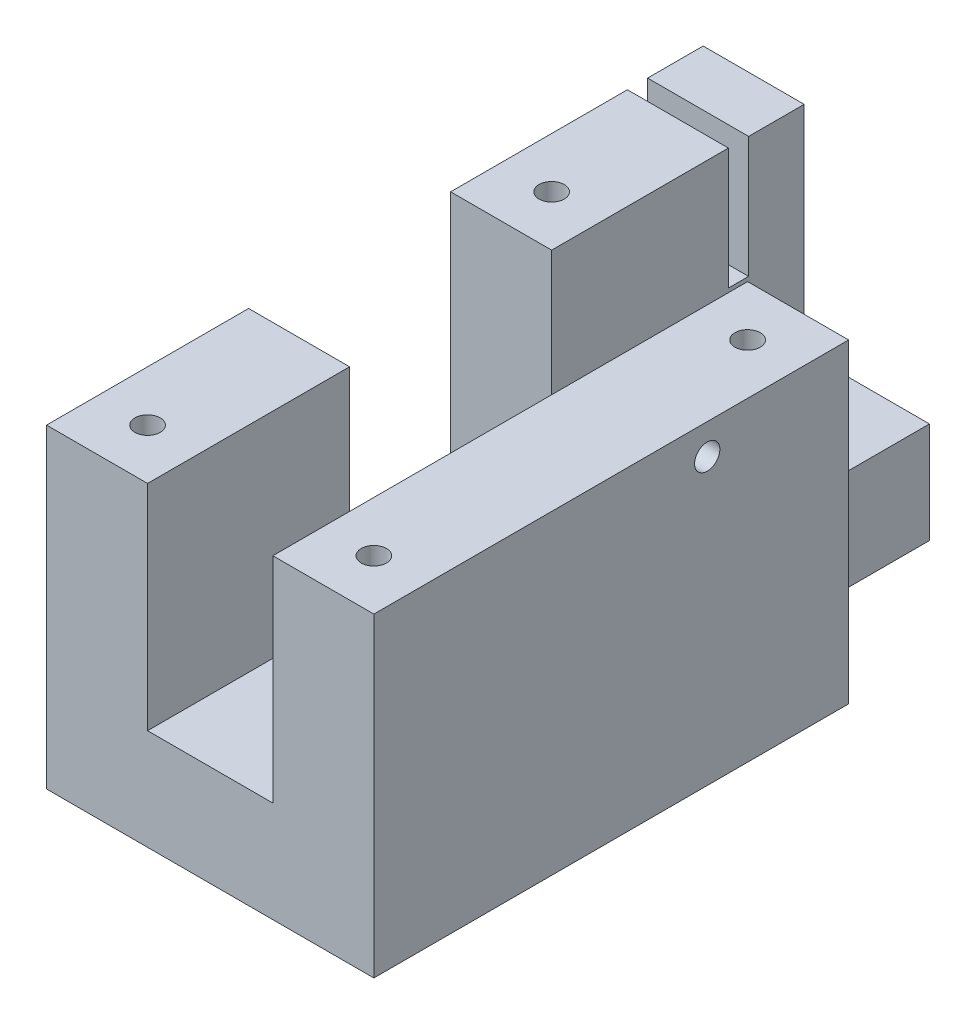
ISO-10303-21;
HEADER;
FILE_DESCRIPTION(('STEP AP214'),'2;1');
FILE_NAME('part.step','',(''),(''),'','','');
FILE_SCHEMA(('AUTOMOTIVE_DESIGN { 1 0 10303 214 1 1 1 1 }'));
ENDSEC;
DATA;
#1=APPLICATION_CONTEXT('core data for automotive mechanical design processes');
#2=APPLICATION_PROTOCOL_DEFINITION('international standard','automotive_design',2000,#1);
#3=PRODUCT_CONTEXT('',#1,'mechanical');
#4=PRODUCT('Part','Part','',(#3));
#5=PRODUCT_RELATED_PRODUCT_CATEGORY('part','',(#4));
#6=PRODUCT_DEFINITION_FORMATION('','',#4);
#7=PRODUCT_DEFINITION_CONTEXT('part definition',#1,'design');
#8=PRODUCT_DEFINITION('design','',#6,#7);
#9=PRODUCT_DEFINITION_SHAPE('','',#8);
#10=(LENGTH_UNIT() NAMED_UNIT(*) SI_UNIT(.MILLI.,.METRE.));
#11=(NAMED_UNIT(*) PLANE_ANGLE_UNIT() SI_UNIT($,.RADIAN.));
#12=(NAMED_UNIT(*) SI_UNIT($,.STERADIAN.) SOLID_ANGLE_UNIT());
#13=UNCERTAINTY_MEASURE_WITH_UNIT(LENGTH_MEASURE(1.E-05),#10,'distance_accuracy_value','');
#14=(GEOMETRIC_REPRESENTATION_CONTEXT(3) GLOBAL_UNCERTAINTY_ASSIGNED_CONTEXT((#13)) GLOBAL_UNIT_ASSIGNED_CONTEXT((#10,
#11,#12)) REPRESENTATION_CONTEXT('',''));
#15=CARTESIAN_POINT('',(0.,0.,0.));
#16=DIRECTION('',(0.,0.,1.));
#17=DIRECTION('',(1.,0.,0.));
#18=AXIS2_PLACEMENT_3D('',#15,#16,#17);
#19=CARTESIAN_POINT('',(10.,10.0000000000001,65.));
#20=DIRECTION('',(-1.,0.,0.));
#21=DIRECTION('',(0.,0.,1.));
#22=AXIS2_PLACEMENT_3D('',#19,#20,#21);
#23=PLANE('',#22);
#24=DIRECTION('',(0.,1.,0.));
#25=VECTOR('',#24,1.);
#26=CARTESIAN_POINT('',(10.,-26.3,45.));
#27=LINE('',#26,#25);
#28=CARTESIAN_POINT('',(10.,10.0000000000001,45.));
#29=VERTEX_POINT('',#28);
#30=CARTESIAN_POINT('',(10.,31.2,45.));
#31=VERTEX_POINT('',#30);
#32=EDGE_CURVE('E309',#29,#31,#27,.T.);
#33=ORIENTED_EDGE('',*,*,#32,.T.);
#34=DIRECTION('',(0.,0.,-1.));
#35=VECTOR('',#34,1.);
#36=CARTESIAN_POINT('',(10.,31.2,65.));
#37=LINE('',#36,#35);
#38=CARTESIAN_POINT('',(10.,31.2,65.));
#39=VERTEX_POINT('',#38);
#40=EDGE_CURVE('E197',#39,#31,#37,.T.);
#41=ORIENTED_EDGE('',*,*,#40,.F.);
#42=DIRECTION('',(0.,1.,0.));
#43=VECTOR('',#42,1.);
#44=CARTESIAN_POINT('',(10.,10.0000000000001,65.));
#45=LINE('',#44,#43);
#46=CARTESIAN_POINT('',(10.,10.0000000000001,65.));
#47=VERTEX_POINT('',#46);
#48=EDGE_CURVE('E250',#47,#39,#45,.T.);
#49=ORIENTED_EDGE('',*,*,#48,.F.);
#50=DIRECTION('',(0.,0.,-1.));
#51=VECTOR('',#50,1.);
#52=CARTESIAN_POINT('',(10.,10.0000000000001,65.));
#53=LINE('',#52,#51);
#54=EDGE_CURVE('E243',#47,#29,#53,.T.);
#55=ORIENTED_EDGE('',*,*,#54,.T.);
#56=EDGE_LOOP('',(#33,#41,#49,#55));
#57=FACE_BOUND('',#56,.T.);
#58=ADVANCED_FACE('F34',(#57),#23,.F.);
#59=DIRECTION('',(0.,1.,0.));
#60=VECTOR('',#59,1.);
#61=CARTESIAN_POINT('',(10.,-26.3,25.));
#62=LINE('',#61,#60);
#63=CARTESIAN_POINT('',(10.,10.0000000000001,25.));
#64=VERTEX_POINT('',#63);
#65=CARTESIAN_POINT('',(10.,31.2,25.));
#66=VERTEX_POINT('',#65);
#67=EDGE_CURVE('E167',#64,#66,#62,.T.);
#68=ORIENTED_EDGE('',*,*,#67,.F.);
#69=CARTESIAN_POINT('',(10.,10.0000000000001,0.));
#70=VERTEX_POINT('',#69);
#71=EDGE_CURVE('E246',#64,#70,#53,.T.);
#72=ORIENTED_EDGE('',*,*,#71,.T.);
#73=DIRECTION('',(0.,1.,0.));
#74=VECTOR('',#73,1.);
#75=CARTESIAN_POINT('',(10.,10.0000000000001,0.));
#76=LINE('',#75,#74);
#77=CARTESIAN_POINT('',(10.,31.2,0.));
#78=VERTEX_POINT('',#77);
#79=EDGE_CURVE('E205',#70,#78,#76,.T.);
#80=ORIENTED_EDGE('',*,*,#79,.T.);
#81=CARTESIAN_POINT('',(10.,31.1999999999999,5.49999999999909));
#82=VERTEX_POINT('',#81);
#83=EDGE_CURVE('E192',#82,#78,#37,.T.);
#84=ORIENTED_EDGE('',*,*,#83,.F.);
#85=DIRECTION('',(0.,1.,0.));
#86=VECTOR('',#85,1.);
#87=CARTESIAN_POINT('',(10.,10.0000000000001,5.49999999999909));
#88=LINE('',#87,#86);
#89=CARTESIAN_POINT('',(10.,19.1999999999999,5.49999999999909));
#90=VERTEX_POINT('',#89);
#91=EDGE_CURVE('E285',#90,#82,#88,.T.);
#92=ORIENTED_EDGE('',*,*,#91,.F.);
#93=DIRECTION('',(0.,0.,-1.));
#94=VECTOR('',#93,1.);
#95=CARTESIAN_POINT('',(10.,19.1999999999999,65.));
#96=LINE('',#95,#94);
#97=CARTESIAN_POINT('',(10.,19.1999999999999,7.5));
#98=VERTEX_POINT('',#97);
#99=EDGE_CURVE('E281',#98,#90,#96,.T.);
#100=ORIENTED_EDGE('',*,*,#99,.F.);
#101=DIRECTION('',(0.,-1.,0.));
#102=VECTOR('',#101,1.);
#103=CARTESIAN_POINT('',(10.,10.0000000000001,7.5));
#104=LINE('',#103,#102);
#105=CARTESIAN_POINT('',(10.,31.1999999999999,7.5));
#106=VERTEX_POINT('',#105);
#107=EDGE_CURVE('E277',#106,#98,#104,.T.);
#108=ORIENTED_EDGE('',*,*,#107,.F.);
#109=EDGE_CURVE('E201',#66,#106,#37,.T.);
#110=ORIENTED_EDGE('',*,*,#109,.F.);
#111=EDGE_LOOP('',(#68,#72,#80,#84,#92,#100,#108,#110));
#112=FACE_BOUND('',#111,.T.);
#113=ADVANCED_FACE('F388',(#112),#23,.F.);
#114=CARTESIAN_POINT('',(0.,31.2,65.));
#115=DIRECTION('',(0.,-1.,0.));
#116=DIRECTION('',(0.,0.,-1.));
#117=AXIS2_PLACEMENT_3D('',#114,#115,#116);
#118=PLANE('',#117);
#119=CARTESIAN_POINT('',(5.,31.2,60.));
#120=DIRECTION('',(0.,1.,0.));
#121=DIRECTION('',(0.,0.,1.));
#122=AXIS2_PLACEMENT_3D('',#119,#120,#121);
#123=CIRCLE('',#122,1.25);
#124=CARTESIAN_POINT('',(5.,31.2,61.25));
#125=VERTEX_POINT('',#124);
#126=EDGE_CURVE('E332',#125,#125,#123,.T.);
#127=ORIENTED_EDGE('',*,*,#126,.F.);
#128=EDGE_LOOP('',(#127));
#129=FACE_BOUND('',#128,.T.);
#130=DIRECTION('',(-1.,0.,0.));
#131=VECTOR('',#130,1.);
#132=CARTESIAN_POINT('',(0.,31.2,45.));
#133=LINE('',#132,#131);
#134=CARTESIAN_POINT('',(0.,31.2,45.));
#135=VERTEX_POINT('',#134);
#136=EDGE_CURVE('E171',#31,#135,#133,.T.);
#137=ORIENTED_EDGE('',*,*,#136,.T.);
#138=DIRECTION('',(0.,0.,-1.));
#139=VECTOR('',#138,1.);
#140=CARTESIAN_POINT('',(0.,31.2,65.));
#141=LINE('',#140,#139);
#142=CARTESIAN_POINT('',(0.,31.2,65.));
#143=VERTEX_POINT('',#142);
#144=EDGE_CURVE('E188',#143,#135,#141,.T.);
#145=ORIENTED_EDGE('',*,*,#144,.F.);
#146=DIRECTION('',(-1.,0.,0.));
#147=VECTOR('',#146,1.);
#148=CARTESIAN_POINT('',(0.,31.2,65.));
#149=LINE('',#148,#147);
#150=EDGE_CURVE('E271',#39,#143,#149,.T.);
#151=ORIENTED_EDGE('',*,*,#150,.F.);
#152=ORIENTED_EDGE('',*,*,#40,.T.);
#153=EDGE_LOOP('',(#137,#145,#151,#152));
#154=FACE_BOUND('',#153,.T.);
#155=ADVANCED_FACE('F393',(#129,#154),#118,.F.);
#156=CARTESIAN_POINT('',(5.,31.2,20.));
#157=DIRECTION('',(0.,1.,0.));
#158=DIRECTION('',(0.,0.,1.));
#159=AXIS2_PLACEMENT_3D('',#156,#157,#158);
#160=CIRCLE('',#159,1.25);
#161=CARTESIAN_POINT('',(5.,31.2,21.25));
#162=VERTEX_POINT('',#161);
#163=EDGE_CURVE('E338',#162,#162,#160,.T.);
#164=ORIENTED_EDGE('',*,*,#163,.F.);
#165=EDGE_LOOP('',(#164));
#166=FACE_BOUND('',#165,.T.);
#167=DIRECTION('',(1.,0.,0.));
#168=VECTOR('',#167,1.);
#169=CARTESIAN_POINT('',(0.,31.2,25.));
#170=LINE('',#169,#168);
#171=CARTESIAN_POINT('',(0.,31.2,25.));
#172=VERTEX_POINT('',#171);
#173=EDGE_CURVE('E160',#172,#66,#170,.T.);
#174=ORIENTED_EDGE('',*,*,#173,.T.);
#175=ORIENTED_EDGE('',*,*,#109,.T.);
#176=DIRECTION('',(1.,0.,0.));
#177=VECTOR('',#176,1.);
#178=CARTESIAN_POINT('',(-25.0999999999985,31.1999999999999,7.5));
#179=LINE('',#178,#177);
#180=CARTESIAN_POINT('',(0.,31.1999999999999,7.5));
#181=VERTEX_POINT('',#180);
#182=EDGE_CURVE('E187',#181,#106,#179,.T.);
#183=ORIENTED_EDGE('',*,*,#182,.F.);
#184=EDGE_CURVE('E178',#172,#181,#141,.T.);
#185=ORIENTED_EDGE('',*,*,#184,.F.);
#186=EDGE_LOOP('',(#174,#175,#183,#185));
#187=FACE_BOUND('',#186,.T.);
#188=ADVANCED_FACE('F185',(#166,#187),#118,.F.);
#189=CARTESIAN_POINT('',(0.,1.13686837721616E-13,65.));
#190=DIRECTION('',(1.,0.,0.));
#191=DIRECTION('',(0.,0.,-1.));
#192=AXIS2_PLACEMENT_3D('',#189,#190,#191);
#193=PLANE('',#192);
#194=DIRECTION('',(0.,1.,0.));
#195=VECTOR('',#194,1.);
#196=CARTESIAN_POINT('',(0.,-26.3,45.));
#197=LINE('',#196,#195);
#198=CARTESIAN_POINT('',(0.,1.14491749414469E-13,45.));
#199=VERTEX_POINT('',#198);
#200=EDGE_CURVE('E211',#199,#135,#197,.T.);
#201=ORIENTED_EDGE('',*,*,#200,.F.);
#202=DIRECTION('',(0.,0.,-1.));
#203=VECTOR('',#202,1.);
#204=CARTESIAN_POINT('',(0.,1.13686837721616E-13,65.));
#205=LINE('',#204,#203);
#206=CARTESIAN_POINT('',(0.,1.13686837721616E-13,65.));
#207=VERTEX_POINT('',#206);
#208=EDGE_CURVE('E193',#207,#199,#205,.T.);
#209=ORIENTED_EDGE('',*,*,#208,.F.);
#210=DIRECTION('',(0.,-1.,0.));
#211=VECTOR('',#210,1.);
#212=CARTESIAN_POINT('',(0.,1.13686837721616E-13,65.));
#213=LINE('',#212,#211);
#214=EDGE_CURVE('E269',#143,#207,#213,.T.);
#215=ORIENTED_EDGE('',*,*,#214,.F.);
#216=ORIENTED_EDGE('',*,*,#144,.T.);
#217=EDGE_LOOP('',(#201,#209,#215,#216));
#218=FACE_BOUND('',#217,.T.);
#219=ADVANCED_FACE('F218',(#218),#193,.F.);
#220=DIRECTION('',(0.,1.,0.));
#221=VECTOR('',#220,1.);
#222=CARTESIAN_POINT('',(0.,-26.3,25.));
#223=LINE('',#222,#221);
#224=CARTESIAN_POINT('',(0.,1.14491749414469E-13,25.));
#225=VERTEX_POINT('',#224);
#226=EDGE_CURVE('E163',#225,#172,#223,.T.);
#227=ORIENTED_EDGE('',*,*,#226,.T.);
#228=ORIENTED_EDGE('',*,*,#184,.T.);
#229=DIRECTION('',(0.,1.,0.));
#230=VECTOR('',#229,1.);
#231=CARTESIAN_POINT('',(0.,1.13686837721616E-13,7.5));
#232=LINE('',#231,#230);
#233=CARTESIAN_POINT('',(0.,19.1999999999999,7.5));
#234=VERTEX_POINT('',#233);
#235=EDGE_CURVE('E279',#234,#181,#232,.T.);
#236=ORIENTED_EDGE('',*,*,#235,.F.);
#237=DIRECTION('',(0.,0.,1.));
#238=VECTOR('',#237,1.);
#239=CARTESIAN_POINT('',(0.,19.1999999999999,65.));
#240=LINE('',#239,#238);
#241=CARTESIAN_POINT('',(0.,19.1999999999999,5.49999999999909));
#242=VERTEX_POINT('',#241);
#243=EDGE_CURVE('E283',#242,#234,#240,.T.);
#244=ORIENTED_EDGE('',*,*,#243,.F.);
#245=DIRECTION('',(0.,-1.,0.));
#246=VECTOR('',#245,1.);
#247=CARTESIAN_POINT('',(0.,1.13686837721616E-13,5.49999999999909));
#248=LINE('',#247,#246);
#249=CARTESIAN_POINT('',(0.,31.2,5.49999999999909));
#250=VERTEX_POINT('',#249);
#251=EDGE_CURVE('E287',#250,#242,#248,.T.);
#252=ORIENTED_EDGE('',*,*,#251,.F.);
#253=CARTESIAN_POINT('',(0.,31.2,0.));
#254=VERTEX_POINT('',#253);
#255=EDGE_CURVE('E189',#250,#254,#141,.T.);
#256=ORIENTED_EDGE('',*,*,#255,.T.);
#257=DIRECTION('',(0.,-1.,0.));
#258=VECTOR('',#257,1.);
#259=CARTESIAN_POINT('',(0.,1.13686837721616E-13,0.));
#260=LINE('',#259,#258);
#261=CARTESIAN_POINT('',(0.,1.13686837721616E-13,0.));
#262=VERTEX_POINT('',#261);
#263=EDGE_CURVE('E253',#254,#262,#260,.T.);
#264=ORIENTED_EDGE('',*,*,#263,.T.);
#265=EDGE_CURVE('E181',#225,#262,#205,.T.);
#266=ORIENTED_EDGE('',*,*,#265,.F.);
#267=EDGE_LOOP('',(#227,#228,#236,#244,#252,#256,#264,#266));
#268=FACE_BOUND('',#267,.T.);
#269=ADVANCED_FACE('F176',(#268),#193,.F.);
#270=CARTESIAN_POINT('',(32.4000000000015,1.13686837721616E-13,65.));
#271=DIRECTION('',(-1.,0.,0.));
#272=DIRECTION('',(0.,0.,1.));
#273=AXIS2_PLACEMENT_3D('',#270,#271,#272);
#274=PLANE('',#273);
#275=CARTESIAN_POINT('',(32.4000000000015,28.1999999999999,32.));
#276=DIRECTION('',(1.,0.,0.));
#277=DIRECTION('',(0.,0.,-1.));
#278=AXIS2_PLACEMENT_3D('',#275,#276,#277);
#279=CIRCLE('',#278,1.25);
#280=CARTESIAN_POINT('',(32.4000000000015,28.1999999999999,30.75));
#281=VERTEX_POINT('',#280);
#282=EDGE_CURVE('E206',#281,#281,#279,.T.);
#283=ORIENTED_EDGE('',*,*,#282,.F.);
#284=EDGE_LOOP('',(#283));
#285=FACE_BOUND('',#284,.T.);
#286=DIRECTION('',(0.,1.,0.));
#287=VECTOR('',#286,1.);
#288=CARTESIAN_POINT('',(32.4000000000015,-26.3,18.));
#289=LINE('',#288,#287);
#290=CARTESIAN_POINT('',(32.4000000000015,1.14491749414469E-13,18.));
#291=VERTEX_POINT('',#290);
#292=CARTESIAN_POINT('',(32.4000000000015,31.2,18.));
#293=VERTEX_POINT('',#292);
#294=EDGE_CURVE('E222',#291,#293,#289,.T.);
#295=ORIENTED_EDGE('',*,*,#294,.T.);
#296=DIRECTION('',(0.,0.,-1.));
#297=VECTOR('',#296,1.);
#298=CARTESIAN_POINT('',(32.4000000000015,31.2,65.));
#299=LINE('',#298,#297);
#300=CARTESIAN_POINT('',(32.4000000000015,31.2,65.));
#301=VERTEX_POINT('',#300);
#302=EDGE_CURVE('E230',#301,#293,#299,.T.);
#303=ORIENTED_EDGE('',*,*,#302,.F.);
#304=DIRECTION('',(0.,1.,0.));
#305=VECTOR('',#304,1.);
#306=CARTESIAN_POINT('',(32.4000000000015,1.13686837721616E-13,65.));
#307=LINE('',#306,#305);
#308=CARTESIAN_POINT('',(32.4000000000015,1.13686837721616E-13,65.));
#309=VERTEX_POINT('',#308);
#310=EDGE_CURVE('E266',#309,#301,#307,.T.);
#311=ORIENTED_EDGE('',*,*,#310,.F.);
#312=DIRECTION('',(0.,0.,-1.));
#313=VECTOR('',#312,1.);
#314=CARTESIAN_POINT('',(32.4000000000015,1.13686837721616E-13,65.));
#315=LINE('',#314,#313);
#316=EDGE_CURVE('E227',#309,#291,#315,.T.);
#317=ORIENTED_EDGE('',*,*,#316,.T.);
#318=EDGE_LOOP('',(#295,#303,#311,#317));
#319=FACE_BOUND('',#318,.T.);
#320=ADVANCED_FACE('F461',(#285,#319),#274,.F.);
#321=CARTESIAN_POINT('',(22.4000000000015,31.2,65.));
#322=DIRECTION('',(0.,-1.,0.));
#323=DIRECTION('',(0.,0.,-1.));
#324=AXIS2_PLACEMENT_3D('',#321,#322,#323);
#325=PLANE('',#324);
#326=CARTESIAN_POINT('',(27.4000000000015,31.2,60.));
#327=DIRECTION('',(0.,1.,0.));
#328=DIRECTION('',(0.,0.,1.));
#329=AXIS2_PLACEMENT_3D('',#326,#327,#328);
#330=CIRCLE('',#329,1.25);
#331=CARTESIAN_POINT('',(27.4000000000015,31.2,61.25));
#332=VERTEX_POINT('',#331);
#333=EDGE_CURVE('E326',#332,#332,#330,.T.);
#334=ORIENTED_EDGE('',*,*,#333,.F.);
#335=EDGE_LOOP('',(#334));
#336=FACE_BOUND('',#335,.T.);
#337=CARTESIAN_POINT('',(27.4000000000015,31.2,23.));
#338=DIRECTION('',(0.,1.,0.));
#339=DIRECTION('',(0.,0.,1.));
#340=AXIS2_PLACEMENT_3D('',#337,#338,#339);
#341=CIRCLE('',#340,1.25);
#342=CARTESIAN_POINT('',(27.4000000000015,31.2,24.25));
#343=VERTEX_POINT('',#342);
#344=EDGE_CURVE('E320',#343,#343,#341,.T.);
#345=ORIENTED_EDGE('',*,*,#344,.F.);
#346=EDGE_LOOP('',(#345));
#347=FACE_BOUND('',#346,.T.);
#348=DIRECTION('',(-1.,0.,0.));
#349=VECTOR('',#348,1.);
#350=CARTESIAN_POINT('',(22.4000000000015,31.2,18.));
#351=LINE('',#350,#349);
#352=CARTESIAN_POINT('',(22.4000000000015,31.2,18.));
#353=VERTEX_POINT('',#352);
#354=EDGE_CURVE('E182',#293,#353,#351,.T.);
#355=ORIENTED_EDGE('',*,*,#354,.T.);
#356=DIRECTION('',(0.,0.,-1.));
#357=VECTOR('',#356,1.);
#358=CARTESIAN_POINT('',(22.4000000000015,31.2,65.));
#359=LINE('',#358,#357);
#360=CARTESIAN_POINT('',(22.4000000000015,31.2,65.));
#361=VERTEX_POINT('',#360);
#362=EDGE_CURVE('E235',#361,#353,#359,.T.);
#363=ORIENTED_EDGE('',*,*,#362,.F.);
#364=DIRECTION('',(-1.,0.,0.));
#365=VECTOR('',#364,1.);
#366=CARTESIAN_POINT('',(22.4000000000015,31.2,65.));
#367=LINE('',#366,#365);
#368=EDGE_CURVE('E264',#301,#361,#367,.T.);
#369=ORIENTED_EDGE('',*,*,#368,.F.);
#370=ORIENTED_EDGE('',*,*,#302,.T.);
#371=EDGE_LOOP('',(#355,#363,#369,#370));
#372=FACE_BOUND('',#371,.T.);
#373=ADVANCED_FACE('F457',(#336,#347,#372),#325,.F.);
#374=CARTESIAN_POINT('',(22.4000000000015,10.0000000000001,65.));
#375=DIRECTION('',(1.,0.,0.));
#376=DIRECTION('',(0.,0.,-1.));
#377=AXIS2_PLACEMENT_3D('',#374,#375,#376);
#378=PLANE('',#377);
#379=CARTESIAN_POINT('',(22.4000000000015,28.1999999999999,32.));
#380=DIRECTION('',(1.,0.,0.));
#381=DIRECTION('',(0.,0.,-1.));
#382=AXIS2_PLACEMENT_3D('',#379,#380,#381);
#383=CIRCLE('',#382,1.25);
#384=CARTESIAN_POINT('',(22.4000000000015,28.1999999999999,30.75));
#385=VERTEX_POINT('',#384);
#386=EDGE_CURVE('E202',#385,#385,#383,.T.);
#387=ORIENTED_EDGE('',*,*,#386,.T.);
#388=EDGE_LOOP('',(#387));
#389=FACE_BOUND('',#388,.T.);
#390=DIRECTION('',(0.,1.,0.));
#391=VECTOR('',#390,1.);
#392=CARTESIAN_POINT('',(22.4000000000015,-26.3,18.));
#393=LINE('',#392,#391);
#394=CARTESIAN_POINT('',(22.4000000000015,10.0000000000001,18.));
#395=VERTEX_POINT('',#394);
#396=EDGE_CURVE('E313',#395,#353,#393,.T.);
#397=ORIENTED_EDGE('',*,*,#396,.F.);
#398=DIRECTION('',(0.,0.,-1.));
#399=VECTOR('',#398,1.);
#400=CARTESIAN_POINT('',(22.4000000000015,10.0000000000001,65.));
#401=LINE('',#400,#399);
#402=CARTESIAN_POINT('',(22.4000000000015,10.0000000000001,65.));
#403=VERTEX_POINT('',#402);
#404=EDGE_CURVE('E240',#403,#395,#401,.T.);
#405=ORIENTED_EDGE('',*,*,#404,.F.);
#406=DIRECTION('',(0.,-1.,0.));
#407=VECTOR('',#406,1.);
#408=CARTESIAN_POINT('',(22.4000000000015,10.0000000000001,65.));
#409=LINE('',#408,#407);
#410=EDGE_CURVE('E262',#361,#403,#409,.T.);
#411=ORIENTED_EDGE('',*,*,#410,.F.);
#412=ORIENTED_EDGE('',*,*,#362,.T.);
#413=EDGE_LOOP('',(#397,#405,#411,#412));
#414=FACE_BOUND('',#413,.T.);
#415=ADVANCED_FACE('F368',(#389,#414),#378,.F.);
#416=CARTESIAN_POINT('',(0.,1.13686837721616E-13,65.));
#417=DIRECTION('',(0.,1.,0.));
#418=DIRECTION('',(0.,0.,1.));
#419=AXIS2_PLACEMENT_3D('',#416,#417,#418);
#420=PLANE('',#419);
#421=CARTESIAN_POINT('',(27.4000000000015,0.,50.));
#422=DIRECTION('',(0.,-1.,0.));
#423=DIRECTION('',(0.,0.,-1.));
#424=AXIS2_PLACEMENT_3D('',#421,#422,#423);
#425=CIRCLE('',#424,2.1);
#426=CARTESIAN_POINT('',(27.4000000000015,0.,47.9));
#427=VERTEX_POINT('',#426);
#428=EDGE_CURVE('E350',#427,#427,#425,.T.);
#429=ORIENTED_EDGE('',*,*,#428,.F.);
#430=EDGE_LOOP('',(#429));
#431=FACE_BOUND('',#430,.T.);
#432=CARTESIAN_POINT('',(5.,0.,50.));
#433=DIRECTION('',(0.,-1.,0.));
#434=DIRECTION('',(0.,0.,-1.));
#435=AXIS2_PLACEMENT_3D('',#432,#433,#434);
#436=CIRCLE('',#435,2.1);
#437=CARTESIAN_POINT('',(5.,0.,47.9));
#438=VERTEX_POINT('',#437);
#439=EDGE_CURVE('E344',#438,#438,#436,.T.);
#440=ORIENTED_EDGE('',*,*,#439,.F.);
#441=EDGE_LOOP('',(#440));
#442=FACE_BOUND('',#441,.T.);
#443=DIRECTION('',(0.,0.,-1.));
#444=VECTOR('',#443,1.);
#445=CARTESIAN_POINT('',(22.4000000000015,1.13686837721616E-13,65.));
#446=LINE('',#445,#444);
#447=CARTESIAN_POINT('',(22.4000000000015,1.14491749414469E-13,18.));
#448=VERTEX_POINT('',#447);
#449=CARTESIAN_POINT('',(22.4000000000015,1.13686837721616E-13,0.));
#450=VERTEX_POINT('',#449);
#451=EDGE_CURVE('E56',#448,#450,#446,.T.);
#452=ORIENTED_EDGE('',*,*,#451,.F.);
#453=DIRECTION('',(-1.,0.,0.));
#454=VECTOR('',#453,1.);
#455=CARTESIAN_POINT('',(0.,1.13686837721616E-13,18.));
#456=LINE('',#455,#454);
#457=EDGE_CURVE('E12',#291,#448,#456,.T.);
#458=ORIENTED_EDGE('',*,*,#457,.F.);
#459=ORIENTED_EDGE('',*,*,#316,.F.);
#460=DIRECTION('',(1.,0.,0.));
#461=VECTOR('',#460,1.);
#462=CARTESIAN_POINT('',(0.,1.13686837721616E-13,65.));
#463=LINE('',#462,#461);
#464=EDGE_CURVE('E226',#207,#309,#463,.T.);
#465=ORIENTED_EDGE('',*,*,#464,.F.);
#466=ORIENTED_EDGE('',*,*,#208,.T.);
#467=DIRECTION('',(-1.,0.,0.));
#468=VECTOR('',#467,1.);
#469=CARTESIAN_POINT('',(0.,1.13686837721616E-13,45.));
#470=LINE('',#469,#468);
#471=CARTESIAN_POINT('',(10.,1.14491749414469E-13,45.));
#472=VERTEX_POINT('',#471);
#473=EDGE_CURVE('E41',#472,#199,#470,.T.);
#474=ORIENTED_EDGE('',*,*,#473,.F.);
#475=DIRECTION('',(0.,0.,1.));
#476=VECTOR('',#475,1.);
#477=CARTESIAN_POINT('',(10.,1.13686837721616E-13,65.));
#478=LINE('',#477,#476);
#479=CARTESIAN_POINT('',(10.,1.14491749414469E-13,25.));
#480=VERTEX_POINT('',#479);
#481=EDGE_CURVE('E293',#480,#472,#478,.T.);
#482=ORIENTED_EDGE('',*,*,#481,.F.);
#483=DIRECTION('',(1.,0.,0.));
#484=VECTOR('',#483,1.);
#485=CARTESIAN_POINT('',(0.,1.13686837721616E-13,25.));
#486=LINE('',#485,#484);
#487=EDGE_CURVE('E200',#225,#480,#486,.T.);
#488=ORIENTED_EDGE('',*,*,#487,.F.);
#489=ORIENTED_EDGE('',*,*,#265,.T.);
#490=DIRECTION('',(1.,0.,0.));
#491=VECTOR('',#490,1.);
#492=CARTESIAN_POINT('',(0.,1.13686837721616E-13,0.));
#493=LINE('',#492,#491);
#494=EDGE_CURVE('E251',#262,#450,#493,.T.);
#495=ORIENTED_EDGE('',*,*,#494,.T.);
#496=EDGE_LOOP('',(#452,#458,#459,#465,#466,#474,#482,#488,#489,#495));
#497=FACE_BOUND('',#496,.T.);
#498=ADVANCED_FACE('F224',(#431,#442,#497),#420,.F.);
#499=CARTESIAN_POINT('',(10.,31.2,0.));
#500=DIRECTION('',(0.,0.,-1.));
#501=DIRECTION('',(-1.,0.,0.));
#502=AXIS2_PLACEMENT_3D('',#499,#500,#501);
#503=PLANE('',#502);
#504=DIRECTION('',(-1.,0.,0.));
#505=VECTOR('',#504,1.);
#506=CARTESIAN_POINT('',(10.,10.0000000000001,0.));
#507=LINE('',#506,#505);
#508=CARTESIAN_POINT('',(22.4000000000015,10.0000000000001,0.));
#509=VERTEX_POINT('',#508);
#510=EDGE_CURVE('E247',#509,#70,#507,.T.);
#511=ORIENTED_EDGE('',*,*,#510,.F.);
#512=DIRECTION('',(0.,1.,0.));
#513=VECTOR('',#512,1.);
#514=CARTESIAN_POINT('',(22.4000000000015,-26.3,0.));
#515=LINE('',#514,#513);
#516=EDGE_CURVE('E305',#450,#509,#515,.T.);
#517=ORIENTED_EDGE('',*,*,#516,.F.);
#518=ORIENTED_EDGE('',*,*,#494,.F.);
#519=ORIENTED_EDGE('',*,*,#263,.F.);
#520=DIRECTION('',(-1.,0.,0.));
#521=VECTOR('',#520,1.);
#522=CARTESIAN_POINT('',(0.,31.2,0.));
#523=LINE('',#522,#521);
#524=EDGE_CURVE('E255',#78,#254,#523,.T.);
#525=ORIENTED_EDGE('',*,*,#524,.F.);
#526=ORIENTED_EDGE('',*,*,#79,.F.);
#527=EDGE_LOOP('',(#511,#517,#518,#519,#525,#526));
#528=FACE_BOUND('',#527,.T.);
#529=ADVANCED_FACE('F367',(#528),#503,.T.);
#530=DIRECTION('',(1.,0.,0.));
#531=VECTOR('',#530,1.);
#532=CARTESIAN_POINT('',(-25.0999999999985,31.1999999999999,5.49999999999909));
#533=LINE('',#532,#531);
#534=EDGE_CURVE('E289',#250,#82,#533,.T.);
#535=ORIENTED_EDGE('',*,*,#534,.T.);
#536=ORIENTED_EDGE('',*,*,#83,.T.);
#537=ORIENTED_EDGE('',*,*,#524,.T.);
#538=ORIENTED_EDGE('',*,*,#255,.F.);
#539=EDGE_LOOP('',(#535,#536,#537,#538));
#540=FACE_BOUND('',#539,.T.);
#541=ADVANCED_FACE('F415',(#540),#118,.F.);
#542=CARTESIAN_POINT('',(10.,10.0000000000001,65.));
#543=DIRECTION('',(0.,-1.,0.));
#544=DIRECTION('',(0.,0.,-1.));
#545=AXIS2_PLACEMENT_3D('',#542,#543,#544);
#546=PLANE('',#545);
#547=ORIENTED_EDGE('',*,*,#510,.T.);
#548=ORIENTED_EDGE('',*,*,#71,.F.);
#549=DIRECTION('',(0.,0.,-1.));
#550=VECTOR('',#549,1.);
#551=CARTESIAN_POINT('',(10.,10.0000000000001,65.));
#552=LINE('',#551,#550);
#553=EDGE_CURVE('E301',#29,#64,#552,.T.);
#554=ORIENTED_EDGE('',*,*,#553,.F.);
#555=ORIENTED_EDGE('',*,*,#54,.F.);
#556=DIRECTION('',(-1.,0.,0.));
#557=VECTOR('',#556,1.);
#558=CARTESIAN_POINT('',(10.,10.0000000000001,65.));
#559=LINE('',#558,#557);
#560=EDGE_CURVE('E260',#403,#47,#559,.T.);
#561=ORIENTED_EDGE('',*,*,#560,.F.);
#562=ORIENTED_EDGE('',*,*,#404,.T.);
#563=DIRECTION('',(0.,0.,1.));
#564=VECTOR('',#563,1.);
#565=CARTESIAN_POINT('',(22.4000000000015,10.0000000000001,65.));
#566=LINE('',#565,#564);
#567=EDGE_CURVE('E304',#509,#395,#566,.T.);
#568=ORIENTED_EDGE('',*,*,#567,.F.);
#569=EDGE_LOOP('',(#547,#548,#554,#555,#561,#562,#568));
#570=FACE_BOUND('',#569,.T.);
#571=ADVANCED_FACE('F406',(#570),#546,.F.);
#572=CARTESIAN_POINT('',(10.,31.2,65.));
#573=DIRECTION('',(0.,0.,-1.));
#574=DIRECTION('',(-1.,0.,0.));
#575=AXIS2_PLACEMENT_3D('',#572,#573,#574);
#576=PLANE('',#575);
#577=ORIENTED_EDGE('',*,*,#48,.T.);
#578=ORIENTED_EDGE('',*,*,#150,.T.);
#579=ORIENTED_EDGE('',*,*,#214,.T.);
#580=ORIENTED_EDGE('',*,*,#464,.T.);
#581=ORIENTED_EDGE('',*,*,#310,.T.);
#582=ORIENTED_EDGE('',*,*,#368,.T.);
#583=ORIENTED_EDGE('',*,*,#410,.T.);
#584=ORIENTED_EDGE('',*,*,#560,.T.);
#585=EDGE_LOOP('',(#577,#578,#579,#580,#581,#582,#583,#584));
#586=FACE_BOUND('',#585,.T.);
#587=ADVANCED_FACE('F401',(#586),#576,.F.);
#588=CARTESIAN_POINT('',(-25.0999999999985,28.1999999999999,32.));
#589=DIRECTION('',(1.,0.,0.));
#590=DIRECTION('',(0.,0.,-1.));
#591=AXIS2_PLACEMENT_3D('',#588,#589,#590);
#592=CYLINDRICAL_SURFACE('',#591,1.25);
#593=ORIENTED_EDGE('',*,*,#282,.T.);
#594=EDGE_LOOP('',(#593));
#595=FACE_BOUND('',#594,.T.);
#596=ORIENTED_EDGE('',*,*,#386,.F.);
#597=EDGE_LOOP('',(#596));
#598=FACE_BOUND('',#597,.T.);
#599=ADVANCED_FACE('F434',(#595,#598),#592,.F.);
#600=CARTESIAN_POINT('',(-25.0999999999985,31.1999999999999,7.5));
#601=DIRECTION('',(0.,0.,-1.));
#602=DIRECTION('',(-1.,0.,0.));
#603=AXIS2_PLACEMENT_3D('',#600,#601,#602);
#604=PLANE('',#603);
#605=ORIENTED_EDGE('',*,*,#107,.T.);
#606=DIRECTION('',(1.,0.,0.));
#607=VECTOR('',#606,1.);
#608=CARTESIAN_POINT('',(-25.0999999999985,19.1999999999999,7.5));
#609=LINE('',#608,#607);
#610=EDGE_CURVE('E296',#234,#98,#609,.T.);
#611=ORIENTED_EDGE('',*,*,#610,.F.);
#612=ORIENTED_EDGE('',*,*,#235,.T.);
#613=ORIENTED_EDGE('',*,*,#182,.T.);
#614=EDGE_LOOP('',(#605,#611,#612,#613));
#615=FACE_BOUND('',#614,.T.);
#616=ADVANCED_FACE('F432',(#615),#604,.T.);
#617=CARTESIAN_POINT('',(-25.0999999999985,19.1999999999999,7.5));
#618=DIRECTION('',(0.,1.,0.));
#619=DIRECTION('',(0.,0.,1.));
#620=AXIS2_PLACEMENT_3D('',#617,#618,#619);
#621=PLANE('',#620);
#622=ORIENTED_EDGE('',*,*,#99,.T.);
#623=DIRECTION('',(1.,0.,0.));
#624=VECTOR('',#623,1.);
#625=CARTESIAN_POINT('',(-25.0999999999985,19.1999999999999,5.49999999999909));
#626=LINE('',#625,#624);
#627=EDGE_CURVE('E292',#242,#90,#626,.T.);
#628=ORIENTED_EDGE('',*,*,#627,.F.);
#629=ORIENTED_EDGE('',*,*,#243,.T.);
#630=ORIENTED_EDGE('',*,*,#610,.T.);
#631=EDGE_LOOP('',(#622,#628,#629,#630));
#632=FACE_BOUND('',#631,.T.);
#633=ADVANCED_FACE('F429',(#632),#621,.T.);
#634=CARTESIAN_POINT('',(-25.0999999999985,31.1999999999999,5.49999999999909));
#635=DIRECTION('',(0.,0.,1.));
#636=DIRECTION('',(1.,0.,0.));
#637=AXIS2_PLACEMENT_3D('',#634,#635,#636);
#638=PLANE('',#637);
#639=ORIENTED_EDGE('',*,*,#91,.T.);
#640=ORIENTED_EDGE('',*,*,#534,.F.);
#641=ORIENTED_EDGE('',*,*,#251,.T.);
#642=ORIENTED_EDGE('',*,*,#627,.T.);
#643=EDGE_LOOP('',(#639,#640,#641,#642));
#644=FACE_BOUND('',#643,.T.);
#645=ADVANCED_FACE('F427',(#644),#638,.T.);
#646=CARTESIAN_POINT('',(22.4000000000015,-26.3,18.));
#647=DIRECTION('',(1.,0.,0.));
#648=DIRECTION('',(0.,0.,-1.));
#649=AXIS2_PLACEMENT_3D('',#646,#647,#648);
#650=PLANE('',#649);
#651=ORIENTED_EDGE('',*,*,#451,.T.);
#652=ORIENTED_EDGE('',*,*,#516,.T.);
#653=ORIENTED_EDGE('',*,*,#567,.T.);
#654=EDGE_CURVE('E315',#448,#395,#393,.T.);
#655=ORIENTED_EDGE('',*,*,#654,.F.);
#656=EDGE_LOOP('',(#651,#652,#653,#655));
#657=FACE_BOUND('',#656,.T.);
#658=ADVANCED_FACE('F447',(#657),#650,.T.);
#659=CARTESIAN_POINT('',(22.4000000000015,-26.3,18.));
#660=DIRECTION('',(0.,0.,-1.));
#661=DIRECTION('',(-1.,0.,0.));
#662=AXIS2_PLACEMENT_3D('',#659,#660,#661);
#663=PLANE('',#662);
#664=ORIENTED_EDGE('',*,*,#457,.T.);
#665=ORIENTED_EDGE('',*,*,#654,.T.);
#666=ORIENTED_EDGE('',*,*,#396,.T.);
#667=ORIENTED_EDGE('',*,*,#354,.F.);
#668=ORIENTED_EDGE('',*,*,#294,.F.);
#669=EDGE_LOOP('',(#664,#665,#666,#667,#668));
#670=FACE_BOUND('',#669,.T.);
#671=ADVANCED_FACE('F672',(#670),#663,.T.);
#672=CARTESIAN_POINT('',(0.,-26.3,45.));
#673=DIRECTION('',(0.,0.,-1.));
#674=DIRECTION('',(-1.,0.,0.));
#675=AXIS2_PLACEMENT_3D('',#672,#673,#674);
#676=PLANE('',#675);
#677=ORIENTED_EDGE('',*,*,#473,.T.);
#678=ORIENTED_EDGE('',*,*,#200,.T.);
#679=ORIENTED_EDGE('',*,*,#136,.F.);
#680=ORIENTED_EDGE('',*,*,#32,.F.);
#681=EDGE_CURVE('E48',#472,#29,#27,.T.);
#682=ORIENTED_EDGE('',*,*,#681,.F.);
#683=EDGE_LOOP('',(#677,#678,#679,#680,#682));
#684=FACE_BOUND('',#683,.T.);
#685=ADVANCED_FACE('F210',(#684),#676,.T.);
#686=CARTESIAN_POINT('',(0.,-26.3,25.));
#687=DIRECTION('',(0.,0.,1.));
#688=DIRECTION('',(1.,0.,0.));
#689=AXIS2_PLACEMENT_3D('',#686,#687,#688);
#690=PLANE('',#689);
#691=ORIENTED_EDGE('',*,*,#487,.T.);
#692=EDGE_CURVE('E308',#480,#64,#62,.T.);
#693=ORIENTED_EDGE('',*,*,#692,.T.);
#694=ORIENTED_EDGE('',*,*,#67,.T.);
#695=ORIENTED_EDGE('',*,*,#173,.F.);
#696=ORIENTED_EDGE('',*,*,#226,.F.);
#697=EDGE_LOOP('',(#691,#693,#694,#695,#696));
#698=FACE_BOUND('',#697,.T.);
#699=ADVANCED_FACE('F162',(#698),#690,.T.);
#700=CARTESIAN_POINT('',(10.,-26.3,45.));
#701=DIRECTION('',(-1.,0.,0.));
#702=DIRECTION('',(0.,0.,1.));
#703=AXIS2_PLACEMENT_3D('',#700,#701,#702);
#704=PLANE('',#703);
#705=ORIENTED_EDGE('',*,*,#481,.T.);
#706=ORIENTED_EDGE('',*,*,#681,.T.);
#707=ORIENTED_EDGE('',*,*,#553,.T.);
#708=ORIENTED_EDGE('',*,*,#692,.F.);
#709=EDGE_LOOP('',(#705,#706,#707,#708));
#710=FACE_BOUND('',#709,.T.);
#711=ADVANCED_FACE('F409',(#710),#704,.T.);
#712=CARTESIAN_POINT('',(27.4000000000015,19.2,23.));
#713=DIRECTION('',(0.,1.,0.));
#714=DIRECTION('',(0.,0.,1.));
#715=AXIS2_PLACEMENT_3D('',#712,#713,#714);
#716=CYLINDRICAL_SURFACE('',#715,1.25);
#717=CARTESIAN_POINT('',(27.4000000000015,19.2,23.));
#718=DIRECTION('',(0.,1.,0.));
#719=DIRECTION('',(0.,0.,1.));
#720=AXIS2_PLACEMENT_3D('',#717,#718,#719);
#721=CIRCLE('',#720,1.25);
#722=CARTESIAN_POINT('',(27.4000000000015,19.2,24.25));
#723=VERTEX_POINT('',#722);
#724=EDGE_CURVE('E172',#723,#723,#721,.T.);
#725=ORIENTED_EDGE('',*,*,#724,.F.);
#726=EDGE_LOOP('',(#725));
#727=FACE_BOUND('',#726,.T.);
#728=ORIENTED_EDGE('',*,*,#344,.T.);
#729=EDGE_LOOP('',(#728));
#730=FACE_BOUND('',#729,.T.);
#731=ADVANCED_FACE('F642',(#727,#730),#716,.F.);
#732=CARTESIAN_POINT('',(27.4000000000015,19.2,23.));
#733=DIRECTION('',(0.,1.,0.));
#734=DIRECTION('',(0.,0.,1.));
#735=AXIS2_PLACEMENT_3D('',#732,#733,#734);
#736=PLANE('',#735);
#737=ORIENTED_EDGE('',*,*,#724,.T.);
#738=EDGE_LOOP('',(#737));
#739=FACE_BOUND('',#738,.T.);
#740=ADVANCED_FACE('F633',(#739),#736,.T.);
#741=CARTESIAN_POINT('',(27.4000000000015,19.2,60.));
#742=DIRECTION('',(0.,1.,0.));
#743=DIRECTION('',(0.,0.,1.));
#744=AXIS2_PLACEMENT_3D('',#741,#742,#743);
#745=CYLINDRICAL_SURFACE('',#744,1.25);
#746=CARTESIAN_POINT('',(27.4000000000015,19.2,60.));
#747=DIRECTION('',(0.,1.,0.));
#748=DIRECTION('',(0.,0.,1.));
#749=AXIS2_PLACEMENT_3D('',#746,#747,#748);
#750=CIRCLE('',#749,1.25);
#751=CARTESIAN_POINT('',(27.4000000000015,19.2,61.25));
#752=VERTEX_POINT('',#751);
#753=EDGE_CURVE('E323',#752,#752,#750,.T.);
#754=ORIENTED_EDGE('',*,*,#753,.F.);
#755=EDGE_LOOP('',(#754));
#756=FACE_BOUND('',#755,.T.);
#757=ORIENTED_EDGE('',*,*,#333,.T.);
#758=EDGE_LOOP('',(#757));
#759=FACE_BOUND('',#758,.T.);
#760=ADVANCED_FACE('F624',(#756,#759),#745,.F.);
#761=CARTESIAN_POINT('',(27.4000000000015,19.2,60.));
#762=DIRECTION('',(0.,1.,0.));
#763=DIRECTION('',(0.,0.,1.));
#764=AXIS2_PLACEMENT_3D('',#761,#762,#763);
#765=PLANE('',#764);
#766=ORIENTED_EDGE('',*,*,#753,.T.);
#767=EDGE_LOOP('',(#766));
#768=FACE_BOUND('',#767,.T.);
#769=ADVANCED_FACE('F615',(#768),#765,.T.);
#770=CARTESIAN_POINT('',(5.,19.2,60.));
#771=DIRECTION('',(0.,1.,0.));
#772=DIRECTION('',(0.,0.,1.));
#773=AXIS2_PLACEMENT_3D('',#770,#771,#772);
#774=CYLINDRICAL_SURFACE('',#773,1.25);
#775=CARTESIAN_POINT('',(5.,19.2,60.));
#776=DIRECTION('',(0.,1.,0.));
#777=DIRECTION('',(0.,0.,1.));
#778=AXIS2_PLACEMENT_3D('',#775,#776,#777);
#779=CIRCLE('',#778,1.25);
#780=CARTESIAN_POINT('',(5.,19.2,61.25));
#781=VERTEX_POINT('',#780);
#782=EDGE_CURVE('E329',#781,#781,#779,.T.);
#783=ORIENTED_EDGE('',*,*,#782,.F.);
#784=EDGE_LOOP('',(#783));
#785=FACE_BOUND('',#784,.T.);
#786=ORIENTED_EDGE('',*,*,#126,.T.);
#787=EDGE_LOOP('',(#786));
#788=FACE_BOUND('',#787,.T.);
#789=ADVANCED_FACE('F606',(#785,#788),#774,.F.);
#790=CARTESIAN_POINT('',(5.,19.2,60.));
#791=DIRECTION('',(0.,1.,0.));
#792=DIRECTION('',(0.,0.,1.));
#793=AXIS2_PLACEMENT_3D('',#790,#791,#792);
#794=PLANE('',#793);
#795=ORIENTED_EDGE('',*,*,#782,.T.);
#796=EDGE_LOOP('',(#795));
#797=FACE_BOUND('',#796,.T.);
#798=ADVANCED_FACE('F597',(#797),#794,.T.);
#799=CARTESIAN_POINT('',(5.,19.2,20.));
#800=DIRECTION('',(0.,1.,0.));
#801=DIRECTION('',(0.,0.,1.));
#802=AXIS2_PLACEMENT_3D('',#799,#800,#801);
#803=CYLINDRICAL_SURFACE('',#802,1.25);
#804=CARTESIAN_POINT('',(5.,19.2,20.));
#805=DIRECTION('',(0.,1.,0.));
#806=DIRECTION('',(0.,0.,1.));
#807=AXIS2_PLACEMENT_3D('',#804,#805,#806);
#808=CIRCLE('',#807,1.25);
#809=CARTESIAN_POINT('',(5.,19.2,21.25));
#810=VERTEX_POINT('',#809);
#811=EDGE_CURVE('E335',#810,#810,#808,.T.);
#812=ORIENTED_EDGE('',*,*,#811,.F.);
#813=EDGE_LOOP('',(#812));
#814=FACE_BOUND('',#813,.T.);
#815=ORIENTED_EDGE('',*,*,#163,.T.);
#816=EDGE_LOOP('',(#815));
#817=FACE_BOUND('',#816,.T.);
#818=ADVANCED_FACE('F383',(#814,#817),#803,.F.);
#819=CARTESIAN_POINT('',(5.,19.2,20.));
#820=DIRECTION('',(0.,1.,0.));
#821=DIRECTION('',(0.,0.,1.));
#822=AXIS2_PLACEMENT_3D('',#819,#820,#821);
#823=PLANE('',#822);
#824=ORIENTED_EDGE('',*,*,#811,.T.);
#825=EDGE_LOOP('',(#824));
#826=FACE_BOUND('',#825,.T.);
#827=ADVANCED_FACE('F374',(#826),#823,.T.);
#828=CARTESIAN_POINT('',(5.,12.,50.));
#829=DIRECTION('',(0.,-1.,0.));
#830=DIRECTION('',(0.,0.,-1.));
#831=AXIS2_PLACEMENT_3D('',#828,#829,#830);
#832=CYLINDRICAL_SURFACE('',#831,2.1);
#833=CARTESIAN_POINT('',(5.,12.,50.));
#834=DIRECTION('',(0.,-1.,0.));
#835=DIRECTION('',(0.,0.,-1.));
#836=AXIS2_PLACEMENT_3D('',#833,#834,#835);
#837=CIRCLE('',#836,2.1);
#838=CARTESIAN_POINT('',(5.,12.,47.9));
#839=VERTEX_POINT('',#838);
#840=EDGE_CURVE('E341',#839,#839,#837,.T.);
#841=ORIENTED_EDGE('',*,*,#840,.F.);
#842=EDGE_LOOP('',(#841));
#843=FACE_BOUND('',#842,.T.);
#844=ORIENTED_EDGE('',*,*,#439,.T.);
#845=EDGE_LOOP('',(#844));
#846=FACE_BOUND('',#845,.T.);
#847=ADVANCED_FACE('F372',(#843,#846),#832,.F.);
#848=CARTESIAN_POINT('',(5.,12.,50.));
#849=DIRECTION('',(0.,-1.,0.));
#850=DIRECTION('',(0.,0.,-1.));
#851=AXIS2_PLACEMENT_3D('',#848,#849,#850);
#852=PLANE('',#851);
#853=ORIENTED_EDGE('',*,*,#840,.T.);
#854=EDGE_LOOP('',(#853));
#855=FACE_BOUND('',#854,.T.);
#856=ADVANCED_FACE('F361',(#855),#852,.T.);
#857=CARTESIAN_POINT('',(27.4000000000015,12.,50.));
#858=DIRECTION('',(0.,-1.,0.));
#859=DIRECTION('',(0.,0.,-1.));
#860=AXIS2_PLACEMENT_3D('',#857,#858,#859);
#861=CYLINDRICAL_SURFACE('',#860,2.1);
#862=CARTESIAN_POINT('',(27.4000000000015,12.,50.));
#863=DIRECTION('',(0.,-1.,0.));
#864=DIRECTION('',(0.,0.,-1.));
#865=AXIS2_PLACEMENT_3D('',#862,#863,#864);
#866=CIRCLE('',#865,2.1);
#867=CARTESIAN_POINT('',(27.4000000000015,12.,47.9));
#868=VERTEX_POINT('',#867);
#869=EDGE_CURVE('E347',#868,#868,#866,.T.);
#870=ORIENTED_EDGE('',*,*,#869,.F.);
#871=EDGE_LOOP('',(#870));
#872=FACE_BOUND('',#871,.T.);
#873=ORIENTED_EDGE('',*,*,#428,.T.);
#874=EDGE_LOOP('',(#873));
#875=FACE_BOUND('',#874,.T.);
#876=ADVANCED_FACE('F358',(#872,#875),#861,.F.);
#877=CARTESIAN_POINT('',(27.4000000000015,12.,50.));
#878=DIRECTION('',(0.,-1.,0.));
#879=DIRECTION('',(0.,0.,-1.));
#880=AXIS2_PLACEMENT_3D('',#877,#878,#879);
#881=PLANE('',#880);
#882=ORIENTED_EDGE('',*,*,#869,.T.);
#883=EDGE_LOOP('',(#882));
#884=FACE_BOUND('',#883,.T.);
#885=ADVANCED_FACE('F356',(#884),#881,.T.);
#886=CLOSED_SHELL('',(#58,#113,#155,#188,#219,#269,#320,#373,#415,#498,#529,#541,#571,#587,#599,
#616,#633,#645,#658,#671,#685,#699,#711,#731,#740,#760,#769,#789,#798,#818,#827,#847,#856,#876,#885));
#887=MANIFOLD_SOLID_BREP('B2',#886);
#888=ADVANCED_BREP_SHAPE_REPRESENTATION('',(#18,#887),#14);
#889=SHAPE_DEFINITION_REPRESENTATION(#9,#888);
ENDSEC;
END-ISO-10303-21;
